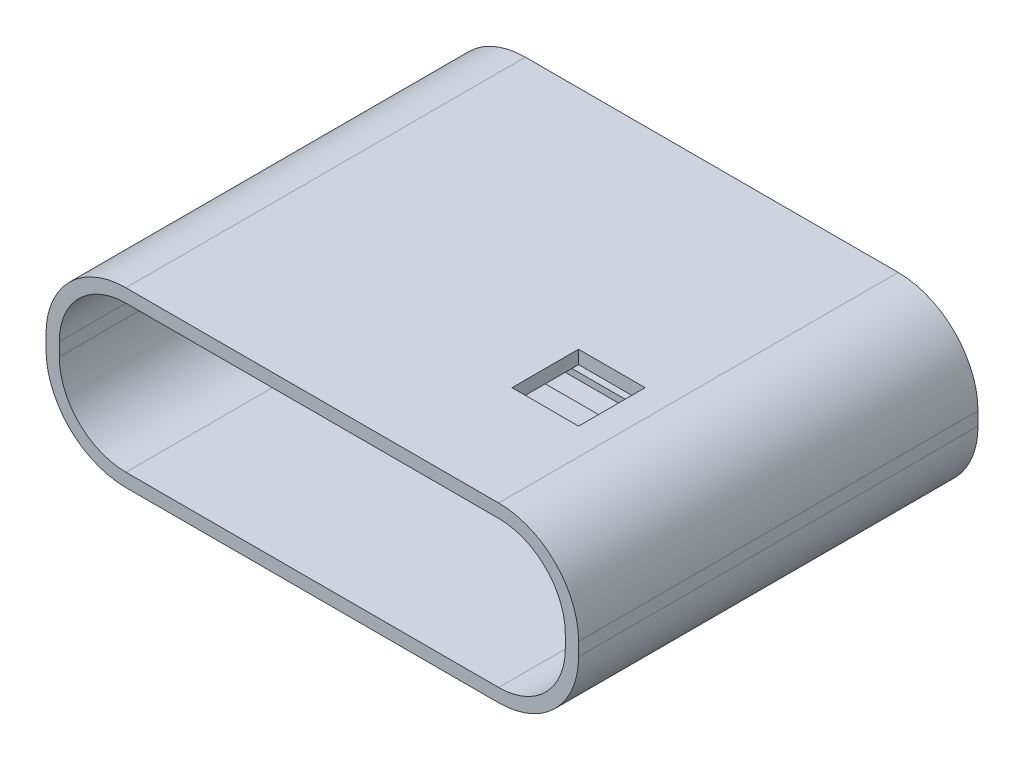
from build123d import *

# Parameters (mm, degrees)
EXTRU_MINCE2_DEPTH      = 30
ESQUISSE3_W             = 5
ESQUISSE3_H             = 5
ENL_V_MAT_EXTRU_1_DEPTH = 1
ESQUISSE4_W             = 12
ESQUISSE4_H             = 2
ENL_V_MAT_EXTRU_2_DEPTH = 0.5


with BuildPart() as part:
    # Esquisse1 → Extru.-Mince2 (new body)
    with BuildSketch(Plane.XY):
        with BuildLine():
            Line((-11.118038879, 5), (-11.118038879, 6))
            ThreePointArc((-11.118038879, 6), (-12.875398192, 10.242640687), (-17.118038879, 12))
            Line((-17.118038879, 12), (-45.118038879, 12))
            ThreePointArc((-45.118038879, 12), (-49.360679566, 10.242640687), (-51.118038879, 6))
            Line((-51.118038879, 6), (-51.118038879, 5))
            ThreePointArc((-51.118038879, 5), (-49.360679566, 0.757359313), (-45.118038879, -1))
            Line((-45.118038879, -1), (-17.118038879, -1))
            ThreePointArc((-17.118038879, -1), (-12.875398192, 0.757359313), (-11.118038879, 5))
        make_face()
        with BuildLine():
            Line((-12.118038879, 5), (-12.118038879, 6))
            ThreePointArc((-12.118038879, 6), (-13.582504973, 9.535533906), (-17.118038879, 11))
            Line((-17.118038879, 11), (-45.118038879, 11))
            ThreePointArc((-45.118038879, 11), (-48.653572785, 9.535533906), (-50.118038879, 6))
            Line((-50.118038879, 6), (-50.118038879, 5))
            ThreePointArc((-50.118038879, 5), (-48.653572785, 1.464466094), (-45.118038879, 0))
            Line((-45.118038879, 0), (-17.118038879, 0))
            ThreePointArc((-17.118038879, 0), (-13.582504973, 1.464466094), (-12.118038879, 5))
        make_face(mode=Mode.SUBTRACT)
    extrude(amount=EXTRU_MINCE2_DEPTH)

    # Esquisse3 → Enl_v. mat.-Extru.1 (cut)
    with BuildSketch(Plane(origin=(0, 12, 0), x_dir=(1, 0, 0), z_dir=(0, 1, 0))):
        with Locations((-21.618038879, -19.5)):
            Rectangle(ESQUISSE3_W, ESQUISSE3_H)
    extrude(amount=-ENL_V_MAT_EXTRU_1_DEPTH, mode=Mode.SUBTRACT)

    # Esquisse4 → Enl_v. mat.-Extru.2 (cut)
    with BuildSketch(Plane(origin=(0, 0, 0), x_dir=(1, 0, 0), z_dir=(0, 1, 0))):
        with Locations((-31.118038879, -7.5)):
            Rectangle(ESQUISSE4_W, ESQUISSE4_H)
    extrude(amount=-ENL_V_MAT_EXTRU_2_DEPTH, mode=Mode.SUBTRACT)


solid = part.part
